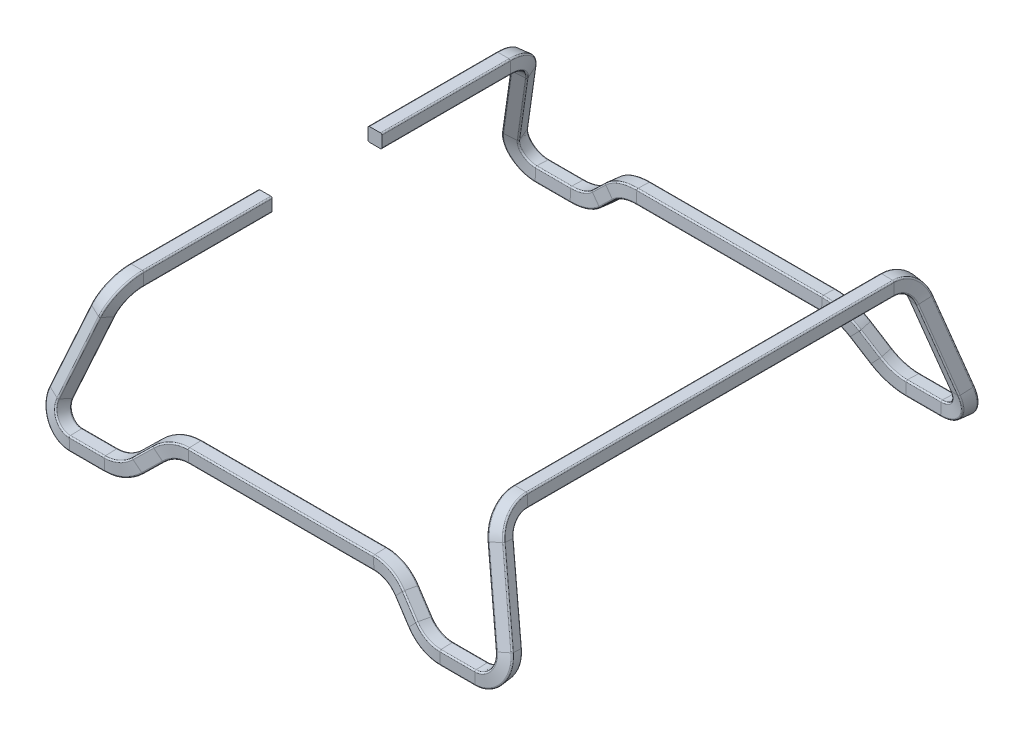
from build123d import *


with BuildPart() as part:
    # Sweep1: sweep along a curve in space
    with BuildLine() as sweep1_path:
        Line((-70, 45, 66.888378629), (-70, 45, 20))
        ThreePointArc((-70, 45, 66.888378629), (-70.706382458, 42.880852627, 73.188044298), (-72.509949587, 37.470151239, 76.673299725))
        Line((-72.509949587, 37.470151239, 76.673299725), (-81.591346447, 10.22596066, 82.727564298))
        ThreePointArc((-73.98395922, 0, 85), (-80.457107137, 3.220549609, 84.284322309), (-81.591346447, 10.22596066, 82.727564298))
        Line((-61.213203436, 0, 85), (-73.98395922, 0, 85))
        ThreePointArc((-50.606601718, 4.288778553, 84.046938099), (-55.47295195, 1.114617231, 84.752307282), (-61.213203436, 0, 85))
        Line((-44.393398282, 10.354027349, 82.699105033), (-50.606601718, 4.288778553, 84.046938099))
        ThreePointArc((-33.786796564, 14.642805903, 81.746043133), (-39.52704805, 13.528188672, 81.993735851), (-44.393398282, 10.354027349, 82.699105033))
        Line((-33.786796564, 14.642805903, 81.746043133), (33.786796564, 14.642805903, 81.746043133))
        ThreePointArc((33.786796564, 14.642805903, 81.746043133), (39.52704805, 13.528188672, 81.993735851), (44.393398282, 10.354027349, 82.699105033))
        Line((44.393398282, 10.354027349, 82.699105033), (50.606601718, 4.288778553, 84.046938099))
        ThreePointArc((50.606601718, 4.288778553, 84.046938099), (55.47295195, 1.114617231, 84.752307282), (61.213203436, 0, 85))
        Line((73.98395922, 0, 85), (61.213203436, 0, 85))
        ThreePointArc((73.98395922, 0, 85), (80.457107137, 3.220549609, 84.284322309), (81.591346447, 10.22596066, 82.727564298))
        Line((72.509949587, 37.470151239, 76.673299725), (81.591346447, 10.22596066, 82.727564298))
        ThreePointArc((70, 45, 66.888378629), (70.706382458, 42.880852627, 73.188044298), (72.509949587, 37.470151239, 76.673299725))
        Line((70, 45, 66.888378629), (70, 45, 0))
    # Sketch5 → Sweep1 (sweep)
    with BuildSketch(Plane.XY):
        with BuildLine():
            Line((72, 42.5), (68, 42.5))
            ThreePointArc((68, 42.5), (67.646446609, 42.646446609), (67.5, 43))
            Line((67.5, 43), (67.5, 47))
            ThreePointArc((67.5, 47), (67.646446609, 47.353553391), (68, 47.5))
            Line((68, 47.5), (72, 47.5))
            ThreePointArc((72, 47.5), (72.353553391, 47.353553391), (72.5, 47))
            Line((72.5, 47), (72.5, 43))
            ThreePointArc((72.5, 43), (72.353553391, 42.646446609), (72, 42.5))
        make_face()
    sweep1 = sweep(path=sweep1_path.line)

    # Mirror1: Sweep1 across plane
    add(sweep1.mirror(Plane.XY))


solid = part.part
